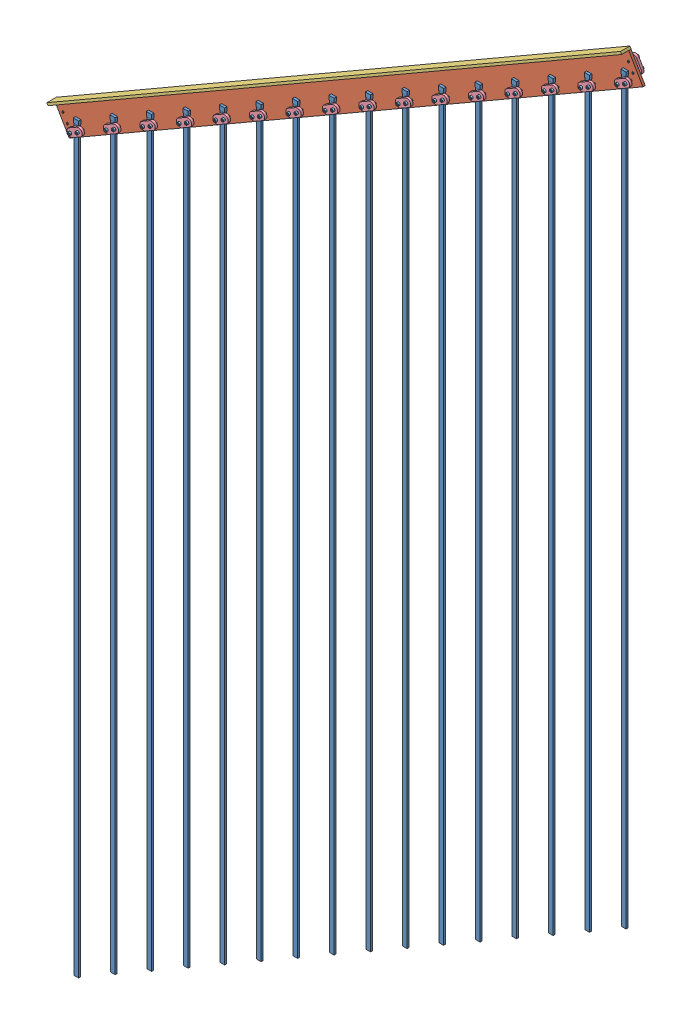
SolidWorks assembly fs-bs-angled-mount-assembly-with-led-strips.SLDASM, configuration Default (file format 9000). Lengths in mm.
Overall size (1586.57 2904.55 44.16).
74 component instances, 5 part files, 0 mates.
Components (placement in the parent):
- fs-led-strip-1: fs-led-strip.SLDPRT [Default] at origin size (14.29 2000 6.35)
- fs-bs-angled-mount-assembly-with-screws-1: fs-bs-angled-mount-assembly-with-screws.SLDASM [Default] at (-24.8458 -53.5614 -9.8077) x (0.866025 0.5 0) z (0 0 1) size (1784.35 82.55 44.16)
  - fs-bs-angled-mount-assembly-1: fs-bs-angled-mount-assembly.SLDASM [Default] at origin size (1784.35 82.55 38)
    - fs-bs-angled-mount-vertical-component-1: fs-bs-angled-mount-vertical-component.SLDPRT [Default] at origin size (1784.35 76.2 6.35)
    - fs-bs-angled-mount-horizontal-component-1: fs-bs-angled-mount-horizontal-component.SLDPRT [Default] at (892.175 76.2 12.7) size (1784.35 6.35 25.4)
    - fs-clamp-1: fs-clamp.SLDPRT [Default] at (27.94 15.24 12.8007) size (44.45 20.32 6.35)
    - fs-clamp-2: fs-clamp.SLDPRT [Default] at (141.478 15.24 12.8007) size (44.45 20.32 6.35)
    - fs-clamp-3: fs-clamp.SLDPRT [Default] at (255.016 15.24 12.8007) size (44.45 20.32 6.35)
    - fs-clamp-4: fs-clamp.SLDPRT [Default] at (368.554 15.24 12.8007) size (44.45 20.32 6.35)
    - fs-clamp-5: fs-clamp.SLDPRT [Default] at (482.092 15.24 12.8007) size (44.45 20.32 6.35)
    - fs-clamp-6: fs-clamp.SLDPRT [Default] at (595.63 15.24 12.8007) size (44.45 20.32 6.35)
    - fs-clamp-7: fs-clamp.SLDPRT [Default] at (709.168 15.24 12.8007) size (44.45 20.32 6.35)
    - fs-clamp-8: fs-clamp.SLDPRT [Default] at (822.706 15.24 12.8007) size (44.45 20.32 6.35)
    - fs-clamp-9: fs-clamp.SLDPRT [Default] at (936.244 15.24 12.8007) size (44.45 20.32 6.35)
    - fs-clamp-10: fs-clamp.SLDPRT [Default] at (1049.782 15.24 12.8007) size (44.45 20.32 6.35)
    - fs-clamp-11: fs-clamp.SLDPRT [Default] at (1163.32 15.24 12.8007) size (44.45 20.32 6.35)
    - fs-clamp-12: fs-clamp.SLDPRT [Default] at (1276.858 15.24 12.8007) size (44.45 20.32 6.35)
    - fs-clamp-13: fs-clamp.SLDPRT [Default] at (1390.396 15.24 12.8007) size (44.45 20.32 6.35)
    - fs-clamp-14: fs-clamp.SLDPRT [Default] at (1503.934 15.24 12.8007) size (44.45 20.32 6.35)
    - fs-clamp-15: fs-clamp.SLDPRT [Default] at (1617.472 15.24 12.8007) size (44.45 20.32 6.35)
    - fs-clamp-16: fs-clamp.SLDPRT [Default] at (1731.01 15.24 12.8007) size (44.45 20.32 6.35)
    - fs-clamp-19: fs-clamp.SLDPRT [Default] at (12.7 53.975 -12.5735) x (0 -1 0) z (0 0 1) size (44.45 20.32 6.35)
    - fs-clamp-20: fs-clamp.SLDPRT [Default] at (1771.65 29.845 -12.5985) x (0 1 0) z (0 0 1) size (44.45 20.32 6.35)
  - socket head cap screw_ai-1: socket head cap screw_ai.sldprt [HX-SHCS 0.19-32x0.875x0.875-N] at (27.94 15.24 25.0524) x (0 0 -1) z (-0.570283 0.821448 0) size (27.05 7.94 7.94)
  - socket head cap screw_ai-3: socket head cap screw_ai.sldprt [HX-SHCS 0.19-32x0.875x0.875-N] at (52.07 15.24 25.3347) x (0 0 -1) z (0.61191 -0.790927 0) size (27.05 7.94 7.94)
  - socket head cap screw_ai-4: socket head cap screw_ai.sldprt [HX-SHCS 0.19-32x0.875x0.875-N] at (12.7 29.845 -18.7638) x (0 0 1) z (-0.601781 -0.798661 0) size (27.05 7.94 7.94)
  - socket head cap screw_ai-5: socket head cap screw_ai.sldprt [HX-SHCS 0.19-32x0.875x0.875-N] at (12.7 53.975 -18.6513) x (0 0 1) z (0.101721 0.994813 0) size (27.05 7.94 7.94)
  - socket head cap screw_ai-6: socket head cap screw_ai.sldprt [HX-SHCS 0.19-32x0.875x0.875-N] at (1771.65 29.845 -18.7537) x (0 0 1) z (-0.220834 -0.975311 0) size (27.05 7.94 7.94)
  - socket head cap screw_ai-7: socket head cap screw_ai.sldprt [HX-SHCS 0.19-32x0.875x0.875-N] at (1771.65 53.975 -18.662) x (0 0 1) z (-0.85708 -0.515183 0) size (27.05 7.94 7.94)
  - socket head cap screw_ai-8: socket head cap screw_ai.sldprt [HX-SHCS 0.19-32x0.875x0.875-N] at (141.478 15.24 25.0524) x (0 0 -1) z (-0.570283 0.821448 0) size (27.05 7.94 7.94)
  - socket head cap screw_ai-9: socket head cap screw_ai.sldprt [HX-SHCS 0.19-32x0.875x0.875-N] at (255.016 15.24 25.0524) x (0 0 -1) z (-0.570283 0.821448 0) size (27.05 7.94 7.94)
  - socket head cap screw_ai-10: socket head cap screw_ai.sldprt [HX-SHCS 0.19-32x0.875x0.875-N] at (368.554 15.24 25.0524) x (0 0 -1) z (-0.570283 0.821448 0) size (27.05 7.94 7.94)
  - socket head cap screw_ai-11: socket head cap screw_ai.sldprt [HX-SHCS 0.19-32x0.875x0.875-N] at (482.092 15.24 25.0524) x (0 0 -1) z (-0.570283 0.821448 0) size (27.05 7.94 7.94)
  - socket head cap screw_ai-12: socket head cap screw_ai.sldprt [HX-SHCS 0.19-32x0.875x0.875-N] at (595.63 15.24 25.0524) x (0 0 -1) z (-0.570283 0.821448 0) size (27.05 7.94 7.94)
  - socket head cap screw_ai-13: socket head cap screw_ai.sldprt [HX-SHCS 0.19-32x0.875x0.875-N] at (709.168 15.24 25.0524) x (0 0 -1) z (-0.570283 0.821448 0) size (27.05 7.94 7.94)
  - socket head cap screw_ai-14: socket head cap screw_ai.sldprt [HX-SHCS 0.19-32x0.875x0.875-N] at (822.706 15.24 25.0524) x (0 0 -1) z (-0.570283 0.821448 0) size (27.05 7.94 7.94)
  - socket head cap screw_ai-15: socket head cap screw_ai.sldprt [HX-SHCS 0.19-32x0.875x0.875-N] at (936.244 15.24 25.0524) x (0 0 -1) z (-0.570283 0.821448 0) size (27.05 7.94 7.94)
  - socket head cap screw_ai-16: socket head cap screw_ai.sldprt [HX-SHCS 0.19-32x0.875x0.875-N] at (1049.782 15.24 25.0524) x (0 0 -1) z (-0.570283 0.821448 0) size (27.05 7.94 7.94)
  - socket head cap screw_ai-17: socket head cap screw_ai.sldprt [HX-SHCS 0.19-32x0.875x0.875-N] at (1163.32 15.24 25.0524) x (0 0 -1) z (-0.570283 0.821448 0) size (27.05 7.94 7.94)
  - socket head cap screw_ai-18: socket head cap screw_ai.sldprt [HX-SHCS 0.19-32x0.875x0.875-N] at (1276.858 15.24 25.0524) x (0 0 -1) z (-0.570283 0.821448 0) size (27.05 7.94 7.94)
  - socket head cap screw_ai-19: socket head cap screw_ai.sldprt [HX-SHCS 0.19-32x0.875x0.875-N] at (1390.396 15.24 25.0524) x (0 0 -1) z (-0.570283 0.821448 0) size (27.05 7.94 7.94)
  - socket head cap screw_ai-20: socket head cap screw_ai.sldprt [HX-SHCS 0.19-32x0.875x0.875-N] at (1503.934 15.24 25.0524) x (0 0 -1) z (-0.570283 0.821448 0) size (27.05 7.94 7.94)
  - socket head cap screw_ai-21: socket head cap screw_ai.sldprt [HX-SHCS 0.19-32x0.875x0.875-N] at (1617.472 15.24 25.0524) x (0 0 -1) z (-0.570283 0.821448 0) size (27.05 7.94 7.94)
  - socket head cap screw_ai-22: socket head cap screw_ai.sldprt [HX-SHCS 0.19-32x0.875x0.875-N] at (1731.01 15.24 25.0524) x (0 0 -1) z (-0.570283 0.821448 0) size (27.05 7.94 7.94)
  - socket head cap screw_ai-25: socket head cap screw_ai.sldprt [HX-SHCS 0.19-32x0.875x0.875-N] at (165.608 15.24 25.3347) x (0 0 -1) z (0.61191 -0.790927 0) size (27.05 7.94 7.94)
  - socket head cap screw_ai-26: socket head cap screw_ai.sldprt [HX-SHCS 0.19-32x0.875x0.875-N] at (279.146 15.24 25.3347) x (0 0 -1) z (0.61191 -0.790927 0) size (27.05 7.94 7.94)
  - socket head cap screw_ai-27: socket head cap screw_ai.sldprt [HX-SHCS 0.19-32x0.875x0.875-N] at (392.684 15.24 25.3347) x (0 0 -1) z (0.61191 -0.790927 0) size (27.05 7.94 7.94)
  - socket head cap screw_ai-28: socket head cap screw_ai.sldprt [HX-SHCS 0.19-32x0.875x0.875-N] at (506.222 15.24 25.3347) x (0 0 -1) z (0.61191 -0.790927 0) size (27.05 7.94 7.94)
  - socket head cap screw_ai-29: socket head cap screw_ai.sldprt [HX-SHCS 0.19-32x0.875x0.875-N] at (619.76 15.24 25.3347) x (0 0 -1) z (0.61191 -0.790927 0) size (27.05 7.94 7.94)
  - socket head cap screw_ai-30: socket head cap screw_ai.sldprt [HX-SHCS 0.19-32x0.875x0.875-N] at (733.298 15.24 25.3347) x (0 0 -1) z (0.61191 -0.790927 0) size (27.05 7.94 7.94)
  - socket head cap screw_ai-31: socket head cap screw_ai.sldprt [HX-SHCS 0.19-32x0.875x0.875-N] at (846.836 15.24 25.3347) x (0 0 -1) z (0.61191 -0.790927 0) size (27.05 7.94 7.94)
  - socket head cap screw_ai-32: socket head cap screw_ai.sldprt [HX-SHCS 0.19-32x0.875x0.875-N] at (960.374 15.24 25.3347) x (0 0 -1) z (0.61191 -0.790927 0) size (27.05 7.94 7.94)
  - socket head cap screw_ai-33: socket head cap screw_ai.sldprt [HX-SHCS 0.19-32x0.875x0.875-N] at (1073.912 15.24 25.3347) x (0 0 -1) z (0.61191 -0.790927 0) size (27.05 7.94 7.94)
  - socket head cap screw_ai-34: socket head cap screw_ai.sldprt [HX-SHCS 0.19-32x0.875x0.875-N] at (1187.45 15.24 25.3347) x (0 0 -1) z (0.61191 -0.790927 0) size (27.05 7.94 7.94)
  - socket head cap screw_ai-35: socket head cap screw_ai.sldprt [HX-SHCS 0.19-32x0.875x0.875-N] at (1300.988 15.24 25.3347) x (0 0 -1) z (0.61191 -0.790927 0) size (27.05 7.94 7.94)
  - socket head cap screw_ai-36: socket head cap screw_ai.sldprt [HX-SHCS 0.19-32x0.875x0.875-N] at (1414.526 15.24 25.3347) x (0 0 -1) z (0.61191 -0.790927 0) size (27.05 7.94 7.94)
  - socket head cap screw_ai-37: socket head cap screw_ai.sldprt [HX-SHCS 0.19-32x0.875x0.875-N] at (1528.064 15.24 25.3347) x (0 0 -1) z (0.61191 -0.790927 0) size (27.05 7.94 7.94)
  - socket head cap screw_ai-38: socket head cap screw_ai.sldprt [HX-SHCS 0.19-32x0.875x0.875-N] at (1641.602 15.24 25.3347) x (0 0 -1) z (0.61191 -0.790927 0) size (27.05 7.94 7.94)
  - socket head cap screw_ai-39: socket head cap screw_ai.sldprt [HX-SHCS 0.19-32x0.875x0.875-N] at (1755.14 15.24 25.3347) x (0 0 -1) z (0.61191 -0.790927 0) size (27.05 7.94 7.94)
- fs-led-strip-2: fs-led-strip.SLDPRT [Default] at (98.3268 56.769 0) size (14.29 2000 6.35)
- fs-led-strip-3: fs-led-strip.SLDPRT [Default] at (196.6536 113.538 0) size (14.29 2000 6.35)
- fs-led-strip-4: fs-led-strip.SLDPRT [Default] at (294.9804 170.307 0) size (14.29 2000 6.35)
- fs-led-strip-5: fs-led-strip.SLDPRT [Default] at (393.3072 227.076 0) size (14.29 2000 6.35)
- fs-led-strip-6: fs-led-strip.SLDPRT [Default] at (491.634 283.845 0) size (14.29 2000 6.35)
- fs-led-strip-7: fs-led-strip.SLDPRT [Default] at (589.9608 340.614 0) size (14.29 2000 6.35)
- fs-led-strip-8: fs-led-strip.SLDPRT [Default] at (688.2875 397.383 0) size (14.29 2000 6.35)
- fs-led-strip-9: fs-led-strip.SLDPRT [Default] at (786.6143 454.152 0) size (14.29 2000 6.35)
- fs-led-strip-10: fs-led-strip.SLDPRT [Default] at (884.9411 510.921 0) size (14.29 2000 6.35)
- fs-led-strip-11: fs-led-strip.SLDPRT [Default] at (983.2679 567.69 0) size (14.29 2000 6.35)
- fs-led-strip-12: fs-led-strip.SLDPRT [Default] at (1081.5947 624.459 0) size (14.29 2000 6.35)
- fs-led-strip-13: fs-led-strip.SLDPRT [Default] at (1179.9215 681.228 0) size (14.29 2000 6.35)
- fs-led-strip-14: fs-led-strip.SLDPRT [Default] at (1278.2483 737.997 0) size (14.29 2000 6.35)
- fs-led-strip-15: fs-led-strip.SLDPRT [Default] at (1376.5751 794.766 0) size (14.29 2000 6.35)
- fs-led-strip-16: fs-led-strip.SLDPRT [Default] at (1474.9019 851.535 0) size (14.29 2000 6.35)
